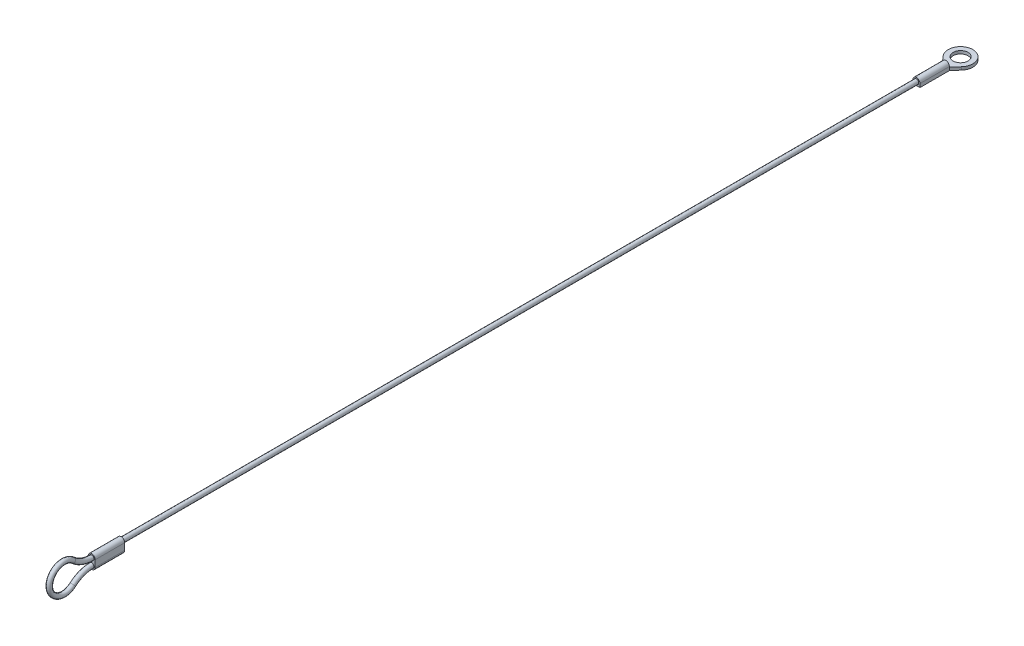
from build123d import *

# Parameters (mm, degrees)
SKETCH2_R           = 0.795
BOSS_EXTRUDE1_DEPTH = 10
BOSS_EXTRUDE2_DEPTH = 10
SKETCH5_R           = 2.54
BOSS_EXTRUDE3_DEPTH = 1.01


with BuildPart() as part:
    # Sweep1: sweep along a path in Sketch1
    with BuildLine(Plane(origin=(0, 0, 0), x_dir=(0, 0, -1), z_dir=(1, 0, 0))) as sweep1_path:
        Line((0, 0), (-280.2, 0))
        ThreePointArc((-280.2, 0), (-283.625492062, 0.631945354), (-286.6, 2.444582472))
        ThreePointArc((-286.6, 2.444582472), (-294.6, -1.133126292), (-286.6, -4.710835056))
        ThreePointArc((-286.6, -4.710835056), (-283.625492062, -2.898197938), (-280.2, -2.266252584))
    # Sketch2 → Sweep1 (sweep)
    with BuildSketch(Plane.XY):
        Circle(SKETCH2_R)
    sweep(path=sweep1_path.line)

    # Sketch3 → Boss-Extrude1 (add)
    with BuildSketch(Plane(origin=(0, 0, 280.2), x_dir=(-1, 0, 0), z_dir=(0, 0, -1))):
        with BuildLine():
            Line((1.195, 0), (1.195, -2.266252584))
            ThreePointArc((1.195, -2.266252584), (0, -3.461252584), (-1.195, -2.266252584))
            Line((-1.195, -2.266252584), (-1.195, 0))
            ThreePointArc((-1.195, 0), (0, 1.195), (1.195, 0))
        make_face()
    extrude(amount=BOSS_EXTRUDE1_DEPTH)

    # Sketch4 → Boss-Extrude2 (add)
    with BuildSketch(Plane(origin=(0, 0, 0), x_dir=(-1, 0, 0), z_dir=(0, 0, -1))):
        with BuildLine():
            Line((-1.195, 0), (-1.195, -1.195))
            Line((-1.195, -1.195), (0, -1.195))
            Line((0, -1.195), (1.195, -1.195))
            Line((1.195, -1.195), (1.195, 0))
            ThreePointArc((1.195, 0), (0, 1.195), (-1.195, 0))
        make_face()
    extrude(amount=BOSS_EXTRUDE2_DEPTH)

    # Sketch5 → Boss-Extrude3 (add)
    with BuildSketch(Plane.XZ.offset(1.195)):
        with BuildLine():
            Line((-1.195, -10), (1.195, -10))
            Line((1.195, -10), (3.155012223, -12.242827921))
            ThreePointArc((3.155012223, -12.242827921), (0, -19.19), (-3.155012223, -12.242827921))
            Line((-3.155012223, -12.242827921), (-1.195, -10))
        make_face()
        with Locations(Location((0, -15, 0), (0, 0, 270))):
            Circle(SKETCH5_R, mode=Mode.SUBTRACT)
    extrude(amount=-BOSS_EXTRUDE3_DEPTH)


solid = part.part
